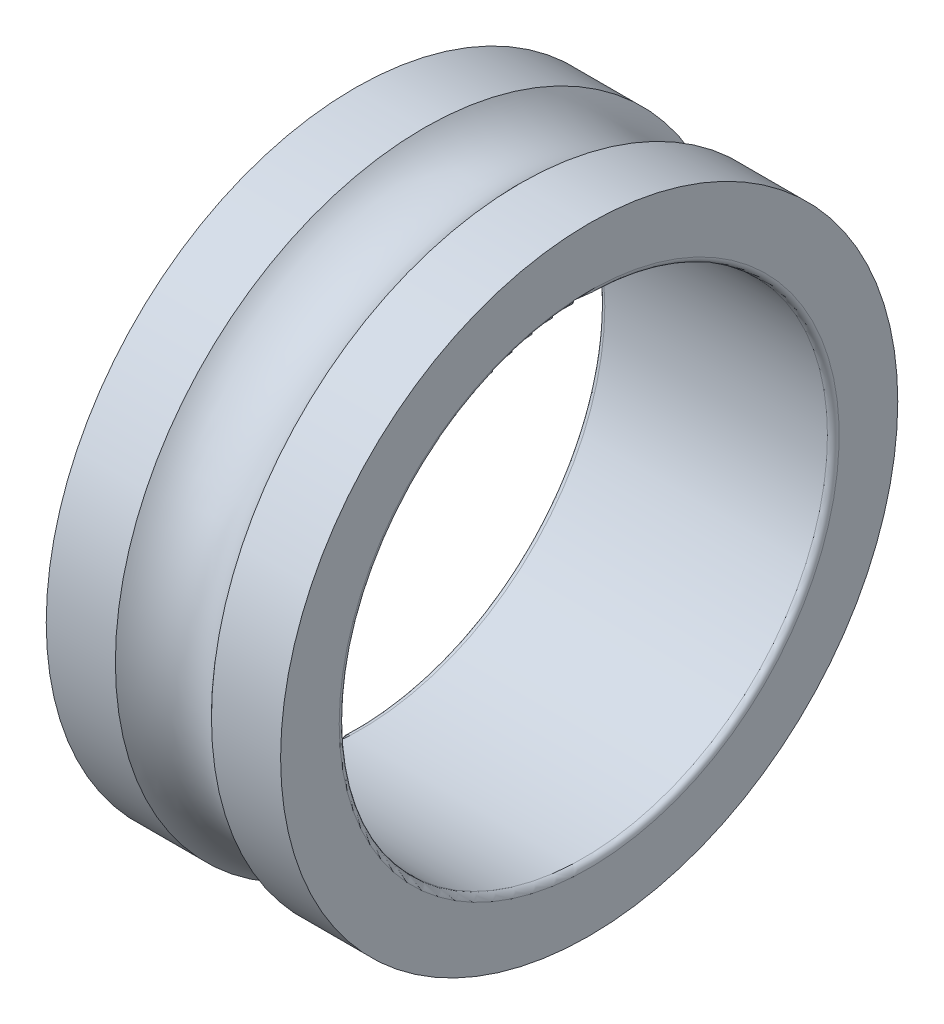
from build123d import *


with BuildPart() as part:
    # Esquisse1 → Base-R_volution (revolve)
    with BuildSketch(Plane(origin=(0, 0, 0), x_dir=(1, 0, 0), z_dir=(0, 1, 0)), mode=Mode.PRIVATE) as base_r_volution_sk:
        with BuildLine():
            Line((0, 15.8), (0, 12.8))
            ThreePointArc((0, 12.8), (0.087867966, 12.587867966), (0.3, 12.5))
            Line((0.3, 12.5), (11.7, 12.5))
            ThreePointArc((11.7, 12.5), (11.912132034, 12.587867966), (12, 12.8))
            Line((12, 12.8), (12, 15.8))
            Line((12, 15.8), (8.459674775, 15.8))
            ThreePointArc((8.459674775, 15.8), (6, 14.7), (3.540325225, 15.8))
            Line((3.540325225, 15.8), (0, 15.8))
        make_face()
    revolve(base_r_volution_sk.sketch.rotate(Axis((0, 0, 0), (1, 0, 0)), 180), axis=Axis((0, 0, 0), (1, 0, 0)))


solid = part.part
